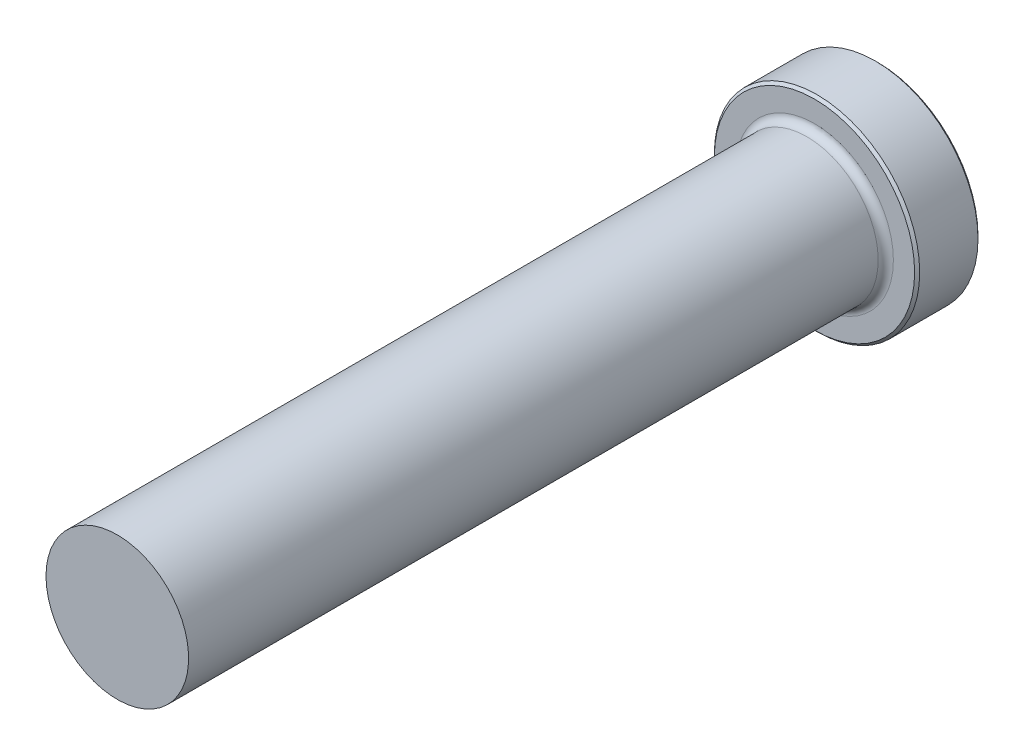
from build123d import *

# Parameters (mm, degrees)
FILLET1_R     = 0.762
CHAMFER1_SIZE = 0.254


with BuildPart() as part:
    # Sketch1 → Revolve1 (revolve)
    with BuildSketch(Plane(origin=(0, 0, 0), x_dir=(0, 0, -1), z_dir=(1, 0, 0)), mode=Mode.PRIVATE) as revolve1_sk:
        Polygon((0, 0), (0, 10.287), (-6.35, 10.287), (-6.35, 7.14375), (-76.2, 7.14375), (-76.2, 0), align=None)
    revolve(revolve1_sk.sketch.rotate(Axis((0, 0, 0), (0, 0, 1)), 90), axis=Axis((0, 0, 0), (0, 0, 1)))

    # Fillet1
    fillet1_edges = [part.edges().sort_by_distance(p)[0] for p in [
        (7.14375, 0, 6.35),
    ]]
    fillet(fillet1_edges, radius=FILLET1_R)

    # Chamfer1
    chamfer1_edges = [part.edges().sort_by_distance(p)[0] for p in [
        (10.287, 0, 6.35),
        (10.287, 0, 0),
    ]]
    chamfer(chamfer1_edges, length=CHAMFER1_SIZE)


solid = part.part
